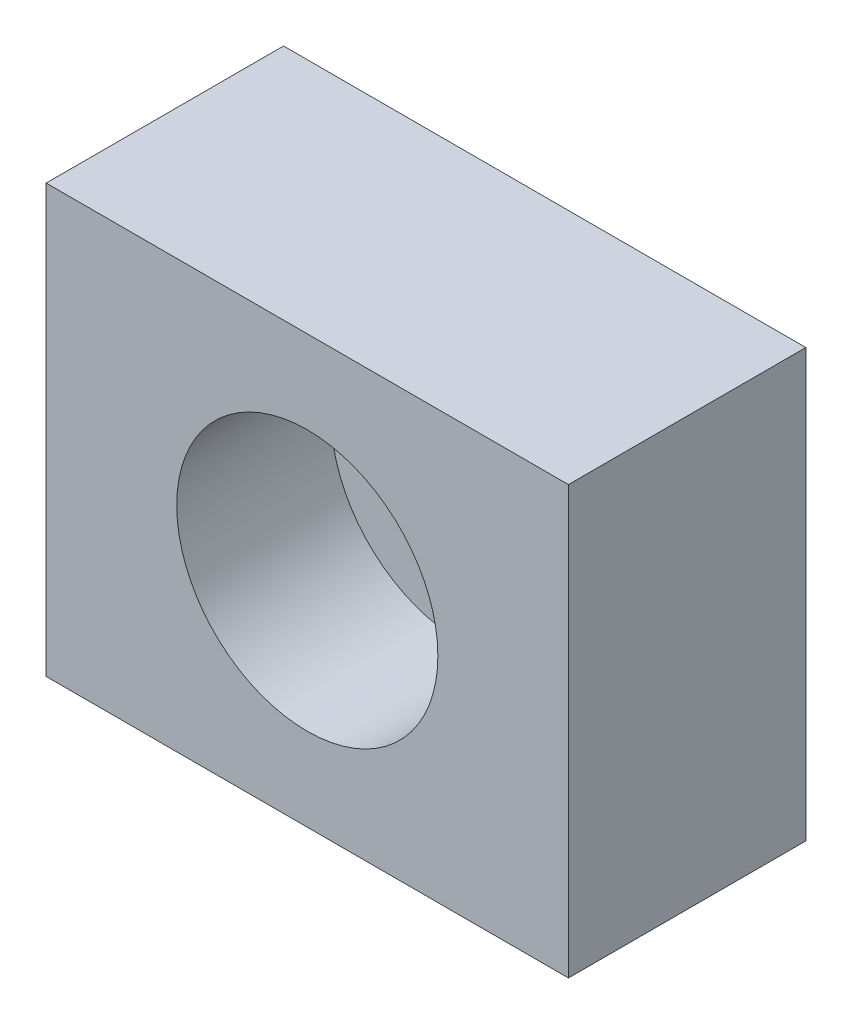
ISO-10303-21;
HEADER;
FILE_DESCRIPTION(('STEP AP214'),'2;1');
FILE_NAME('part.step','',(''),(''),'','','');
FILE_SCHEMA(('AUTOMOTIVE_DESIGN { 1 0 10303 214 1 1 1 1 }'));
ENDSEC;
DATA;
#1=APPLICATION_CONTEXT('core data for automotive mechanical design processes');
#2=APPLICATION_PROTOCOL_DEFINITION('international standard','automotive_design',2000,#1);
#3=PRODUCT_CONTEXT('',#1,'mechanical');
#4=PRODUCT('Part','Part','',(#3));
#5=PRODUCT_RELATED_PRODUCT_CATEGORY('part','',(#4));
#6=PRODUCT_DEFINITION_FORMATION('','',#4);
#7=PRODUCT_DEFINITION_CONTEXT('part definition',#1,'design');
#8=PRODUCT_DEFINITION('design','',#6,#7);
#9=PRODUCT_DEFINITION_SHAPE('','',#8);
#10=(LENGTH_UNIT() NAMED_UNIT(*) SI_UNIT(.MILLI.,.METRE.));
#11=(NAMED_UNIT(*) PLANE_ANGLE_UNIT() SI_UNIT($,.RADIAN.));
#12=(NAMED_UNIT(*) SI_UNIT($,.STERADIAN.) SOLID_ANGLE_UNIT());
#13=UNCERTAINTY_MEASURE_WITH_UNIT(LENGTH_MEASURE(1.E-05),#10,'distance_accuracy_value','');
#14=(GEOMETRIC_REPRESENTATION_CONTEXT(3) GLOBAL_UNCERTAINTY_ASSIGNED_CONTEXT((#13)) GLOBAL_UNIT_ASSIGNED_CONTEXT((#10,
#11,#12)) REPRESENTATION_CONTEXT('',''));
#15=CARTESIAN_POINT('',(0.,0.,0.));
#16=DIRECTION('',(0.,0.,1.));
#17=DIRECTION('',(1.,0.,0.));
#18=AXIS2_PLACEMENT_3D('',#15,#16,#17);
#19=CARTESIAN_POINT('',(11.,-9.,10.));
#20=DIRECTION('',(0.,0.,1.));
#21=DIRECTION('',(1.,0.,0.));
#22=AXIS2_PLACEMENT_3D('',#19,#20,#21);
#23=PLANE('',#22);
#24=DIRECTION('',(1.,0.,0.));
#25=VECTOR('',#24,1.);
#26=CARTESIAN_POINT('',(-11.,-9.,10.));
#27=LINE('',#26,#25);
#28=CARTESIAN_POINT('',(-11.,-9.,10.));
#29=VERTEX_POINT('',#28);
#30=CARTESIAN_POINT('',(11.,-9.,10.));
#31=VERTEX_POINT('',#30);
#32=EDGE_CURVE('E84',#29,#31,#27,.T.);
#33=ORIENTED_EDGE('',*,*,#32,.T.);
#34=DIRECTION('',(0.,1.,0.));
#35=VECTOR('',#34,1.);
#36=CARTESIAN_POINT('',(11.,-9.,10.));
#37=LINE('',#36,#35);
#38=CARTESIAN_POINT('',(11.,9.,10.));
#39=VERTEX_POINT('',#38);
#40=EDGE_CURVE('E61',#31,#39,#37,.T.);
#41=ORIENTED_EDGE('',*,*,#40,.T.);
#42=DIRECTION('',(-1.,0.,0.));
#43=VECTOR('',#42,1.);
#44=CARTESIAN_POINT('',(11.,9.,10.));
#45=LINE('',#44,#43);
#46=CARTESIAN_POINT('',(-11.,9.,10.));
#47=VERTEX_POINT('',#46);
#48=EDGE_CURVE('E81',#39,#47,#45,.T.);
#49=ORIENTED_EDGE('',*,*,#48,.T.);
#50=DIRECTION('',(0.,-1.,0.));
#51=VECTOR('',#50,1.);
#52=CARTESIAN_POINT('',(-11.,9.,10.));
#53=LINE('',#52,#51);
#54=EDGE_CURVE('E78',#47,#29,#53,.T.);
#55=ORIENTED_EDGE('',*,*,#54,.T.);
#56=EDGE_LOOP('',(#33,#41,#49,#55));
#57=FACE_BOUND('',#56,.T.);
#58=CARTESIAN_POINT('',(0.,0.,10.));
#59=DIRECTION('',(0.,0.,1.));
#60=DIRECTION('',(1.,0.,0.));
#61=AXIS2_PLACEMENT_3D('',#58,#59,#60);
#62=CIRCLE('',#61,5.5);
#63=CARTESIAN_POINT('',(5.5,0.,10.));
#64=VERTEX_POINT('',#63);
#65=EDGE_CURVE('E69',#64,#64,#62,.T.);
#66=ORIENTED_EDGE('',*,*,#65,.F.);
#67=EDGE_LOOP('',(#66));
#68=FACE_BOUND('',#67,.T.);
#69=ADVANCED_FACE('F14',(#57,#68),#23,.T.);
#70=CARTESIAN_POINT('',(-11.,-9.,10.));
#71=DIRECTION('',(0.,1.,0.));
#72=DIRECTION('',(0.,0.,1.));
#73=AXIS2_PLACEMENT_3D('',#70,#71,#72);
#74=PLANE('',#73);
#75=DIRECTION('',(0.,0.,-1.));
#76=VECTOR('',#75,1.);
#77=CARTESIAN_POINT('',(11.,-9.,10.));
#78=LINE('',#77,#76);
#79=CARTESIAN_POINT('',(11.,-9.,0.));
#80=VERTEX_POINT('',#79);
#81=EDGE_CURVE('E9',#31,#80,#78,.T.);
#82=ORIENTED_EDGE('',*,*,#81,.F.);
#83=ORIENTED_EDGE('',*,*,#32,.F.);
#84=DIRECTION('',(0.,0.,-1.));
#85=VECTOR('',#84,1.);
#86=CARTESIAN_POINT('',(-11.,-9.,10.));
#87=LINE('',#86,#85);
#88=CARTESIAN_POINT('',(-11.,-9.,0.));
#89=VERTEX_POINT('',#88);
#90=EDGE_CURVE('E29',#29,#89,#87,.T.);
#91=ORIENTED_EDGE('',*,*,#90,.T.);
#92=DIRECTION('',(1.,0.,0.));
#93=VECTOR('',#92,1.);
#94=CARTESIAN_POINT('',(-11.,-9.,0.));
#95=LINE('',#94,#93);
#96=EDGE_CURVE('E65',#89,#80,#95,.T.);
#97=ORIENTED_EDGE('',*,*,#96,.T.);
#98=EDGE_LOOP('',(#82,#83,#91,#97));
#99=FACE_BOUND('',#98,.T.);
#100=ADVANCED_FACE('F66',(#99),#74,.F.);
#101=CARTESIAN_POINT('',(11.,-9.,10.));
#102=DIRECTION('',(-1.,0.,0.));
#103=DIRECTION('',(0.,0.,1.));
#104=AXIS2_PLACEMENT_3D('',#101,#102,#103);
#105=PLANE('',#104);
#106=DIRECTION('',(0.,0.,-1.));
#107=VECTOR('',#106,1.);
#108=CARTESIAN_POINT('',(11.,9.,10.));
#109=LINE('',#108,#107);
#110=CARTESIAN_POINT('',(11.,9.,0.));
#111=VERTEX_POINT('',#110);
#112=EDGE_CURVE('E22',#39,#111,#109,.T.);
#113=ORIENTED_EDGE('',*,*,#112,.F.);
#114=ORIENTED_EDGE('',*,*,#40,.F.);
#115=ORIENTED_EDGE('',*,*,#81,.T.);
#116=DIRECTION('',(0.,1.,0.));
#117=VECTOR('',#116,1.);
#118=CARTESIAN_POINT('',(11.,-9.,0.));
#119=LINE('',#118,#117);
#120=EDGE_CURVE('E58',#80,#111,#119,.T.);
#121=ORIENTED_EDGE('',*,*,#120,.T.);
#122=EDGE_LOOP('',(#113,#114,#115,#121));
#123=FACE_BOUND('',#122,.T.);
#124=ADVANCED_FACE('F16',(#123),#105,.F.);
#125=CARTESIAN_POINT('',(11.,9.,10.));
#126=DIRECTION('',(0.,-1.,0.));
#127=DIRECTION('',(1.,0.,0.));
#128=AXIS2_PLACEMENT_3D('',#125,#126,#127);
#129=PLANE('',#128);
#130=DIRECTION('',(0.,0.,-1.));
#131=VECTOR('',#130,1.);
#132=CARTESIAN_POINT('',(-11.,9.,10.));
#133=LINE('',#132,#131);
#134=CARTESIAN_POINT('',(-11.,9.,0.));
#135=VERTEX_POINT('',#134);
#136=EDGE_CURVE('E37',#47,#135,#133,.T.);
#137=ORIENTED_EDGE('',*,*,#136,.F.);
#138=ORIENTED_EDGE('',*,*,#48,.F.);
#139=ORIENTED_EDGE('',*,*,#112,.T.);
#140=DIRECTION('',(-1.,0.,0.));
#141=VECTOR('',#140,1.);
#142=CARTESIAN_POINT('',(11.,9.,0.));
#143=LINE('',#142,#141);
#144=EDGE_CURVE('E72',#111,#135,#143,.T.);
#145=ORIENTED_EDGE('',*,*,#144,.T.);
#146=EDGE_LOOP('',(#137,#138,#139,#145));
#147=FACE_BOUND('',#146,.T.);
#148=ADVANCED_FACE('F87',(#147),#129,.F.);
#149=CARTESIAN_POINT('',(-11.,9.,10.));
#150=DIRECTION('',(1.,0.,0.));
#151=DIRECTION('',(0.,0.,-1.));
#152=AXIS2_PLACEMENT_3D('',#149,#150,#151);
#153=PLANE('',#152);
#154=ORIENTED_EDGE('',*,*,#54,.F.);
#155=ORIENTED_EDGE('',*,*,#136,.T.);
#156=DIRECTION('',(0.,-1.,0.));
#157=VECTOR('',#156,1.);
#158=CARTESIAN_POINT('',(-11.,9.,0.));
#159=LINE('',#158,#157);
#160=EDGE_CURVE('E74',#135,#89,#159,.T.);
#161=ORIENTED_EDGE('',*,*,#160,.T.);
#162=ORIENTED_EDGE('',*,*,#90,.F.);
#163=EDGE_LOOP('',(#154,#155,#161,#162));
#164=FACE_BOUND('',#163,.T.);
#165=ADVANCED_FACE('F90',(#164),#153,.F.);
#166=CARTESIAN_POINT('',(11.,-9.,0.));
#167=DIRECTION('',(0.,0.,1.));
#168=DIRECTION('',(1.,0.,0.));
#169=AXIS2_PLACEMENT_3D('',#166,#167,#168);
#170=PLANE('',#169);
#171=CARTESIAN_POINT('',(0.,0.,0.));
#172=DIRECTION('',(0.,0.,1.));
#173=DIRECTION('',(1.,0.,0.));
#174=AXIS2_PLACEMENT_3D('',#171,#172,#173);
#175=CIRCLE('',#174,3.5);
#176=CARTESIAN_POINT('',(3.5,0.,0.));
#177=VERTEX_POINT('',#176);
#178=EDGE_CURVE('E100',#177,#177,#175,.T.);
#179=ORIENTED_EDGE('',*,*,#178,.T.);
#180=EDGE_LOOP('',(#179));
#181=FACE_BOUND('',#180,.T.);
#182=ORIENTED_EDGE('',*,*,#96,.F.);
#183=ORIENTED_EDGE('',*,*,#160,.F.);
#184=ORIENTED_EDGE('',*,*,#144,.F.);
#185=ORIENTED_EDGE('',*,*,#120,.F.);
#186=EDGE_LOOP('',(#182,#183,#184,#185));
#187=FACE_BOUND('',#186,.T.);
#188=ADVANCED_FACE('F71',(#181,#187),#170,.F.);
#189=CARTESIAN_POINT('',(0.,0.,10.));
#190=DIRECTION('',(0.,0.,1.));
#191=DIRECTION('',(1.,0.,0.));
#192=AXIS2_PLACEMENT_3D('',#189,#190,#191);
#193=CYLINDRICAL_SURFACE('',#192,5.5);
#194=ORIENTED_EDGE('',*,*,#65,.T.);
#195=EDGE_LOOP('',(#194));
#196=FACE_BOUND('',#195,.T.);
#197=CARTESIAN_POINT('',(0.,0.,3.5));
#198=DIRECTION('',(0.,0.,1.));
#199=DIRECTION('',(1.,0.,0.));
#200=AXIS2_PLACEMENT_3D('',#197,#198,#199);
#201=CIRCLE('',#200,5.5);
#202=CARTESIAN_POINT('',(5.5,0.,3.5));
#203=VERTEX_POINT('',#202);
#204=EDGE_CURVE('E94',#203,#203,#201,.T.);
#205=ORIENTED_EDGE('',*,*,#204,.F.);
#206=EDGE_LOOP('',(#205));
#207=FACE_BOUND('',#206,.T.);
#208=ADVANCED_FACE('F114',(#196,#207),#193,.F.);
#209=CARTESIAN_POINT('',(3.5,0.,3.5));
#210=DIRECTION('',(0.,0.,1.));
#211=DIRECTION('',(1.,0.,0.));
#212=AXIS2_PLACEMENT_3D('',#209,#210,#211);
#213=PLANE('',#212);
#214=ORIENTED_EDGE('',*,*,#204,.T.);
#215=EDGE_LOOP('',(#214));
#216=FACE_BOUND('',#215,.T.);
#217=CARTESIAN_POINT('',(0.,0.,3.5));
#218=DIRECTION('',(0.,0.,1.));
#219=DIRECTION('',(1.,0.,0.));
#220=AXIS2_PLACEMENT_3D('',#217,#218,#219);
#221=CIRCLE('',#220,3.5);
#222=CARTESIAN_POINT('',(3.5,0.,3.5));
#223=VERTEX_POINT('',#222);
#224=EDGE_CURVE('E97',#223,#223,#221,.T.);
#225=ORIENTED_EDGE('',*,*,#224,.F.);
#226=EDGE_LOOP('',(#225));
#227=FACE_BOUND('',#226,.T.);
#228=ADVANCED_FACE('F107',(#216,#227),#213,.T.);
#229=CARTESIAN_POINT('',(0.,0.,10.));
#230=DIRECTION('',(0.,0.,1.));
#231=DIRECTION('',(1.,0.,0.));
#232=AXIS2_PLACEMENT_3D('',#229,#230,#231);
#233=CYLINDRICAL_SURFACE('',#232,3.5);
#234=ORIENTED_EDGE('',*,*,#224,.T.);
#235=EDGE_LOOP('',(#234));
#236=FACE_BOUND('',#235,.T.);
#237=ORIENTED_EDGE('',*,*,#178,.F.);
#238=EDGE_LOOP('',(#237));
#239=FACE_BOUND('',#238,.T.);
#240=ADVANCED_FACE('F105',(#236,#239),#233,.F.);
#241=CLOSED_SHELL('',(#69,#100,#124,#148,#165,#188,#208,#228,#240));
#242=MANIFOLD_SOLID_BREP('B1',#241);
#243=ADVANCED_BREP_SHAPE_REPRESENTATION('',(#18,#242),#14);
#244=SHAPE_DEFINITION_REPRESENTATION(#9,#243);
ENDSEC;
END-ISO-10303-21;
